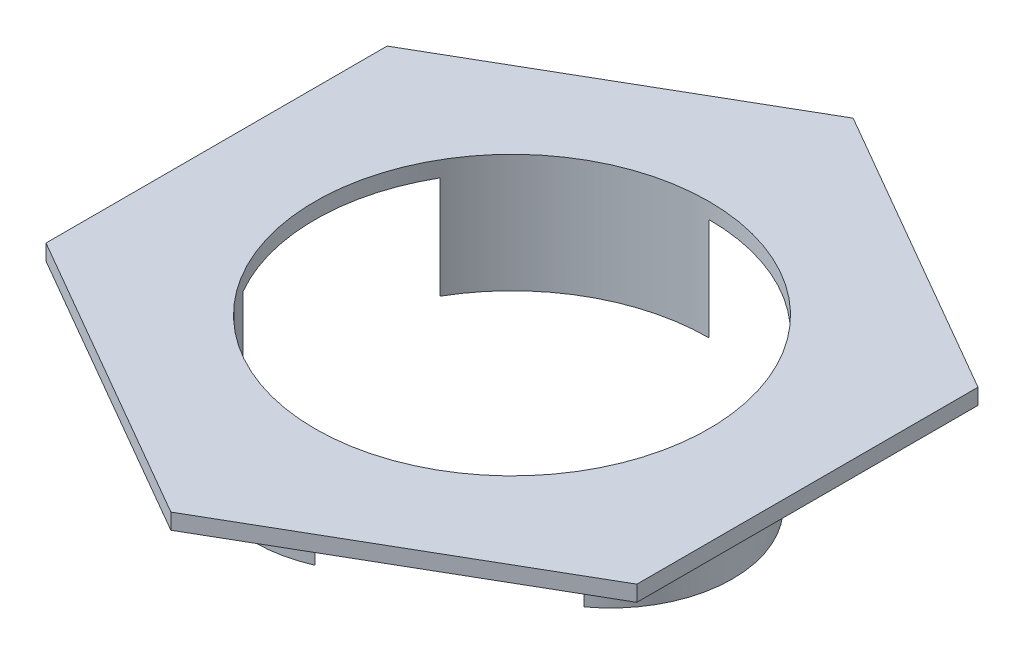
ISO-10303-21;
HEADER;
FILE_DESCRIPTION(('STEP AP214'),'2;1');
FILE_NAME('part.step','',(''),(''),'','','');
FILE_SCHEMA(('AUTOMOTIVE_DESIGN { 1 0 10303 214 1 1 1 1 }'));
ENDSEC;
DATA;
#1=APPLICATION_CONTEXT('core data for automotive mechanical design processes');
#2=APPLICATION_PROTOCOL_DEFINITION('international standard','automotive_design',2000,#1);
#3=PRODUCT_CONTEXT('',#1,'mechanical');
#4=PRODUCT('Part','Part','',(#3));
#5=PRODUCT_RELATED_PRODUCT_CATEGORY('part','',(#4));
#6=PRODUCT_DEFINITION_FORMATION('','',#4);
#7=PRODUCT_DEFINITION_CONTEXT('part definition',#1,'design');
#8=PRODUCT_DEFINITION('design','',#6,#7);
#9=PRODUCT_DEFINITION_SHAPE('','',#8);
#10=(LENGTH_UNIT() NAMED_UNIT(*) SI_UNIT(.MILLI.,.METRE.));
#11=(NAMED_UNIT(*) PLANE_ANGLE_UNIT() SI_UNIT($,.RADIAN.));
#12=(NAMED_UNIT(*) SI_UNIT($,.STERADIAN.) SOLID_ANGLE_UNIT());
#13=UNCERTAINTY_MEASURE_WITH_UNIT(LENGTH_MEASURE(1.E-05),#10,'distance_accuracy_value','');
#14=(GEOMETRIC_REPRESENTATION_CONTEXT(3) GLOBAL_UNCERTAINTY_ASSIGNED_CONTEXT((#13)) GLOBAL_UNIT_ASSIGNED_CONTEXT((#10,
#11,#12)) REPRESENTATION_CONTEXT('',''));
#15=CARTESIAN_POINT('',(0.,0.,0.));
#16=DIRECTION('',(0.,0.,1.));
#17=DIRECTION('',(1.,0.,0.));
#18=AXIS2_PLACEMENT_3D('',#15,#16,#17);
#19=CARTESIAN_POINT('',(0.,25.4,-549.91));
#20=DIRECTION('',(0.,1.,0.));
#21=DIRECTION('',(0.,0.,1.));
#22=AXIS2_PLACEMENT_3D('',#19,#20,#21);
#23=PLANE('',#22);
#24=DIRECTION('',(-0.866025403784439,0.,-0.5));
#25=VECTOR('',#24,1.);
#26=CARTESIAN_POINT('',(476.236029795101,25.4,-274.955));
#27=LINE('',#26,#25);
#28=CARTESIAN_POINT('',(476.236029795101,25.4,-274.955));
#29=VERTEX_POINT('',#28);
#30=CARTESIAN_POINT('',(0.,25.4,-549.91));
#31=VERTEX_POINT('',#30);
#32=EDGE_CURVE('E266',#29,#31,#27,.T.);
#33=ORIENTED_EDGE('',*,*,#32,.T.);
#34=DIRECTION('',(-0.866025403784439,0.,0.5));
#35=VECTOR('',#34,1.);
#36=CARTESIAN_POINT('',(0.,25.4,-549.91));
#37=LINE('',#36,#35);
#38=CARTESIAN_POINT('',(-476.2360297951,25.4,-274.955));
#39=VERTEX_POINT('',#38);
#40=EDGE_CURVE('E284',#31,#39,#37,.T.);
#41=ORIENTED_EDGE('',*,*,#40,.T.);
#42=DIRECTION('',(0.,0.,1.));
#43=VECTOR('',#42,1.);
#44=CARTESIAN_POINT('',(-476.2360297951,25.4,-274.955));
#45=LINE('',#44,#43);
#46=CARTESIAN_POINT('',(-476.2360297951,25.4,274.955));
#47=VERTEX_POINT('',#46);
#48=EDGE_CURVE('E252',#39,#47,#45,.T.);
#49=ORIENTED_EDGE('',*,*,#48,.T.);
#50=DIRECTION('',(0.866025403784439,0.,0.5));
#51=VECTOR('',#50,1.);
#52=CARTESIAN_POINT('',(-476.2360297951,25.4,274.955));
#53=LINE('',#52,#51);
#54=CARTESIAN_POINT('',(0.,25.4,549.91));
#55=VERTEX_POINT('',#54);
#56=EDGE_CURVE('E279',#47,#55,#53,.T.);
#57=ORIENTED_EDGE('',*,*,#56,.T.);
#58=DIRECTION('',(0.866025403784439,0.,-0.5));
#59=VECTOR('',#58,1.);
#60=CARTESIAN_POINT('',(0.,25.4,549.91));
#61=LINE('',#60,#59);
#62=CARTESIAN_POINT('',(476.236029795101,25.4,274.955));
#63=VERTEX_POINT('',#62);
#64=EDGE_CURVE('E281',#55,#63,#61,.T.);
#65=ORIENTED_EDGE('',*,*,#64,.T.);
#66=DIRECTION('',(0.,0.,-1.));
#67=VECTOR('',#66,1.);
#68=CARTESIAN_POINT('',(476.236029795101,25.4,274.955));
#69=LINE('',#68,#67);
#70=EDGE_CURVE('E271',#63,#29,#69,.T.);
#71=ORIENTED_EDGE('',*,*,#70,.T.);
#72=EDGE_LOOP('',(#33,#41,#49,#57,#65,#71));
#73=FACE_BOUND('',#72,.T.);
#74=CARTESIAN_POINT('',(0.,25.4,0.));
#75=DIRECTION('',(0.,1.,0.));
#76=DIRECTION('',(0.,0.,1.));
#77=AXIS2_PLACEMENT_3D('',#74,#75,#76);
#78=CIRCLE('',#77,317.5);
#79=CARTESIAN_POINT('',(0.,25.4,317.5));
#80=VERTEX_POINT('',#79);
#81=EDGE_CURVE('E167',#80,#80,#78,.T.);
#82=ORIENTED_EDGE('',*,*,#81,.F.);
#83=EDGE_LOOP('',(#82));
#84=FACE_BOUND('',#83,.T.);
#85=ADVANCED_FACE('F33',(#73,#84),#23,.T.);
#86=CARTESIAN_POINT('',(0.,0.,-549.91));
#87=DIRECTION('',(0.,1.,0.));
#88=DIRECTION('',(0.,0.,1.));
#89=AXIS2_PLACEMENT_3D('',#86,#87,#88);
#90=PLANE('',#89);
#91=DIRECTION('',(-0.866025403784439,0.,-0.5));
#92=VECTOR('',#91,1.);
#93=CARTESIAN_POINT('',(476.236029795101,0.,-274.955));
#94=LINE('',#93,#92);
#95=CARTESIAN_POINT('',(476.236029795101,0.,-274.955));
#96=VERTEX_POINT('',#95);
#97=CARTESIAN_POINT('',(0.,0.,-549.91));
#98=VERTEX_POINT('',#97);
#99=EDGE_CURVE('E248',#96,#98,#94,.T.);
#100=ORIENTED_EDGE('',*,*,#99,.F.);
#101=DIRECTION('',(0.,0.,-1.));
#102=VECTOR('',#101,1.);
#103=CARTESIAN_POINT('',(476.236029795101,0.,274.955));
#104=LINE('',#103,#102);
#105=CARTESIAN_POINT('',(476.236029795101,0.,274.955));
#106=VERTEX_POINT('',#105);
#107=EDGE_CURVE('E264',#106,#96,#104,.T.);
#108=ORIENTED_EDGE('',*,*,#107,.F.);
#109=DIRECTION('',(0.866025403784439,0.,-0.5));
#110=VECTOR('',#109,1.);
#111=CARTESIAN_POINT('',(0.,0.,549.91));
#112=LINE('',#111,#110);
#113=CARTESIAN_POINT('',(0.,0.,549.91));
#114=VERTEX_POINT('',#113);
#115=EDGE_CURVE('E259',#114,#106,#112,.T.);
#116=ORIENTED_EDGE('',*,*,#115,.F.);
#117=DIRECTION('',(0.866025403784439,0.,0.5));
#118=VECTOR('',#117,1.);
#119=CARTESIAN_POINT('',(-476.2360297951,0.,274.955));
#120=LINE('',#119,#118);
#121=CARTESIAN_POINT('',(-476.2360297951,0.,274.955));
#122=VERTEX_POINT('',#121);
#123=EDGE_CURVE('E257',#122,#114,#120,.T.);
#124=ORIENTED_EDGE('',*,*,#123,.F.);
#125=DIRECTION('',(0.,0.,1.));
#126=VECTOR('',#125,1.);
#127=CARTESIAN_POINT('',(-476.2360297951,0.,-274.955));
#128=LINE('',#127,#126);
#129=CARTESIAN_POINT('',(-476.2360297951,0.,-274.955));
#130=VERTEX_POINT('',#129);
#131=EDGE_CURVE('E247',#130,#122,#128,.T.);
#132=ORIENTED_EDGE('',*,*,#131,.F.);
#133=DIRECTION('',(-0.866025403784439,0.,0.5));
#134=VECTOR('',#133,1.);
#135=CARTESIAN_POINT('',(0.,0.,-549.91));
#136=LINE('',#135,#134);
#137=EDGE_CURVE('E240',#98,#130,#136,.T.);
#138=ORIENTED_EDGE('',*,*,#137,.F.);
#139=EDGE_LOOP('',(#100,#108,#116,#124,#132,#138));
#140=FACE_BOUND('',#139,.T.);
#141=CARTESIAN_POINT('',(0.,0.,0.));
#142=DIRECTION('',(0.,1.,0.));
#143=DIRECTION('',(0.,0.,1.));
#144=AXIS2_PLACEMENT_3D('',#141,#142,#143);
#145=CIRCLE('',#144,317.5);
#146=CARTESIAN_POINT('',(274.963065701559,0.,-158.75));
#147=VERTEX_POINT('',#146);
#148=CARTESIAN_POINT('',(-4.85722573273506E-13,0.,-317.5));
#149=VERTEX_POINT('',#148);
#150=EDGE_CURVE('E51',#147,#149,#145,.T.);
#151=ORIENTED_EDGE('',*,*,#150,.T.);
#152=CARTESIAN_POINT('',(-79.5079519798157,0.,-137.711812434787));
#153=DIRECTION('',(0.,-1.,0.));
#154=DIRECTION('',(0.,0.,-1.));
#155=AXIS2_PLACEMENT_3D('',#152,#153,#154);
#156=CIRCLE('',#155,196.584096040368);
#157=CARTESIAN_POINT('',(-274.963065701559,0.,-158.75));
#158=VERTEX_POINT('',#157);
#159=EDGE_CURVE('E132',#149,#158,#156,.F.);
#160=ORIENTED_EDGE('',*,*,#159,.T.);
#161=CARTESIAN_POINT('',(-274.963065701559,0.,158.75));
#162=VERTEX_POINT('',#161);
#163=EDGE_CURVE('E37',#158,#162,#145,.T.);
#164=ORIENTED_EDGE('',*,*,#163,.T.);
#165=CARTESIAN_POINT('',(-79.5079519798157,0.,137.711812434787));
#166=DIRECTION('',(0.,-1.,0.));
#167=DIRECTION('',(0.,0.,-1.));
#168=AXIS2_PLACEMENT_3D('',#165,#166,#167);
#169=CIRCLE('',#168,196.584096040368);
#170=CARTESIAN_POINT('',(-3.60822483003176E-13,0.,317.5));
#171=VERTEX_POINT('',#170);
#172=EDGE_CURVE('E158',#162,#171,#169,.F.);
#173=ORIENTED_EDGE('',*,*,#172,.T.);
#174=CARTESIAN_POINT('',(274.963065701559,0.,158.75));
#175=VERTEX_POINT('',#174);
#176=EDGE_CURVE('E57',#171,#175,#145,.T.);
#177=ORIENTED_EDGE('',*,*,#176,.T.);
#178=CARTESIAN_POINT('',(159.015903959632,0.,0.));
#179=DIRECTION('',(0.,-1.,0.));
#180=DIRECTION('',(0.,0.,-1.));
#181=AXIS2_PLACEMENT_3D('',#178,#179,#180);
#182=CIRCLE('',#181,196.584096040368);
#183=EDGE_CURVE('E134',#175,#147,#182,.F.);
#184=ORIENTED_EDGE('',*,*,#183,.T.);
#185=EDGE_LOOP('',(#151,#160,#164,#173,#177,#184));
#186=FACE_BOUND('',#185,.T.);
#187=ADVANCED_FACE('F180',(#140,#186),#90,.F.);
#188=CARTESIAN_POINT('',(476.236029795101,25.4,-274.955));
#189=DIRECTION('',(-0.5,0.,0.866025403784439));
#190=DIRECTION('',(0.866025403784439,0.,0.5));
#191=AXIS2_PLACEMENT_3D('',#188,#189,#190);
#192=PLANE('',#191);
#193=ORIENTED_EDGE('',*,*,#99,.T.);
#194=DIRECTION('',(0.,-1.,0.));
#195=VECTOR('',#194,1.);
#196=CARTESIAN_POINT('',(0.,25.4,-549.91));
#197=LINE('',#196,#195);
#198=EDGE_CURVE('E11',#31,#98,#197,.T.);
#199=ORIENTED_EDGE('',*,*,#198,.F.);
#200=ORIENTED_EDGE('',*,*,#32,.F.);
#201=DIRECTION('',(0.,-1.,0.));
#202=VECTOR('',#201,1.);
#203=CARTESIAN_POINT('',(476.236029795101,25.4,-274.955));
#204=LINE('',#203,#202);
#205=EDGE_CURVE('E267',#29,#96,#204,.T.);
#206=ORIENTED_EDGE('',*,*,#205,.T.);
#207=EDGE_LOOP('',(#193,#199,#200,#206));
#208=FACE_BOUND('',#207,.T.);
#209=ADVANCED_FACE('F35',(#208),#192,.F.);
#210=CARTESIAN_POINT('',(0.,25.4,-549.91));
#211=DIRECTION('',(0.5,0.,0.866025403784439));
#212=DIRECTION('',(0.866025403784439,0.,-0.5));
#213=AXIS2_PLACEMENT_3D('',#210,#211,#212);
#214=PLANE('',#213);
#215=ORIENTED_EDGE('',*,*,#137,.T.);
#216=DIRECTION('',(0.,-1.,0.));
#217=VECTOR('',#216,1.);
#218=CARTESIAN_POINT('',(-476.2360297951,25.4,-274.955));
#219=LINE('',#218,#217);
#220=EDGE_CURVE('E43',#39,#130,#219,.T.);
#221=ORIENTED_EDGE('',*,*,#220,.F.);
#222=ORIENTED_EDGE('',*,*,#40,.F.);
#223=ORIENTED_EDGE('',*,*,#198,.T.);
#224=EDGE_LOOP('',(#215,#221,#222,#223));
#225=FACE_BOUND('',#224,.T.);
#226=ADVANCED_FACE('F231',(#225),#214,.F.);
#227=CARTESIAN_POINT('',(-476.2360297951,25.4,-274.955));
#228=DIRECTION('',(1.,0.,0.));
#229=DIRECTION('',(0.,0.,-1.));
#230=AXIS2_PLACEMENT_3D('',#227,#228,#229);
#231=PLANE('',#230);
#232=ORIENTED_EDGE('',*,*,#131,.T.);
#233=DIRECTION('',(0.,-1.,0.));
#234=VECTOR('',#233,1.);
#235=CARTESIAN_POINT('',(-476.2360297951,25.4,274.955));
#236=LINE('',#235,#234);
#237=EDGE_CURVE('E253',#47,#122,#236,.T.);
#238=ORIENTED_EDGE('',*,*,#237,.F.);
#239=ORIENTED_EDGE('',*,*,#48,.F.);
#240=ORIENTED_EDGE('',*,*,#220,.T.);
#241=EDGE_LOOP('',(#232,#238,#239,#240));
#242=FACE_BOUND('',#241,.T.);
#243=ADVANCED_FACE('F228',(#242),#231,.F.);
#244=CARTESIAN_POINT('',(-476.2360297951,25.4,274.955));
#245=DIRECTION('',(0.5,0.,-0.866025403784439));
#246=DIRECTION('',(-0.866025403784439,0.,-0.5));
#247=AXIS2_PLACEMENT_3D('',#244,#245,#246);
#248=PLANE('',#247);
#249=ORIENTED_EDGE('',*,*,#123,.T.);
#250=DIRECTION('',(0.,-1.,0.));
#251=VECTOR('',#250,1.);
#252=CARTESIAN_POINT('',(0.,25.4,549.91));
#253=LINE('',#252,#251);
#254=EDGE_CURVE('E274',#55,#114,#253,.T.);
#255=ORIENTED_EDGE('',*,*,#254,.F.);
#256=ORIENTED_EDGE('',*,*,#56,.F.);
#257=ORIENTED_EDGE('',*,*,#237,.T.);
#258=EDGE_LOOP('',(#249,#255,#256,#257));
#259=FACE_BOUND('',#258,.T.);
#260=ADVANCED_FACE('F224',(#259),#248,.F.);
#261=CARTESIAN_POINT('',(0.,25.4,549.91));
#262=DIRECTION('',(-0.5,0.,-0.866025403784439));
#263=DIRECTION('',(-0.866025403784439,0.,0.5));
#264=AXIS2_PLACEMENT_3D('',#261,#262,#263);
#265=PLANE('',#264);
#266=ORIENTED_EDGE('',*,*,#115,.T.);
#267=DIRECTION('',(0.,-1.,0.));
#268=VECTOR('',#267,1.);
#269=CARTESIAN_POINT('',(476.236029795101,25.4,274.955));
#270=LINE('',#269,#268);
#271=EDGE_CURVE('E270',#63,#106,#270,.T.);
#272=ORIENTED_EDGE('',*,*,#271,.F.);
#273=ORIENTED_EDGE('',*,*,#64,.F.);
#274=ORIENTED_EDGE('',*,*,#254,.T.);
#275=EDGE_LOOP('',(#266,#272,#273,#274));
#276=FACE_BOUND('',#275,.T.);
#277=ADVANCED_FACE('F220',(#276),#265,.F.);
#278=CARTESIAN_POINT('',(476.236029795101,25.4,274.955));
#279=DIRECTION('',(-1.,0.,0.));
#280=DIRECTION('',(0.,0.,1.));
#281=AXIS2_PLACEMENT_3D('',#278,#279,#280);
#282=PLANE('',#281);
#283=ORIENTED_EDGE('',*,*,#107,.T.);
#284=ORIENTED_EDGE('',*,*,#205,.F.);
#285=ORIENTED_EDGE('',*,*,#70,.F.);
#286=ORIENTED_EDGE('',*,*,#271,.T.);
#287=EDGE_LOOP('',(#283,#284,#285,#286));
#288=FACE_BOUND('',#287,.T.);
#289=ADVANCED_FACE('F217',(#288),#282,.F.);
#290=CARTESIAN_POINT('',(0.,25.4,0.));
#291=DIRECTION('',(0.,-1.,0.));
#292=DIRECTION('',(0.,0.,-1.));
#293=AXIS2_PLACEMENT_3D('',#290,#291,#292);
#294=CYLINDRICAL_SURFACE('',#293,317.5);
#295=ORIENTED_EDGE('',*,*,#81,.T.);
#296=EDGE_LOOP('',(#295));
#297=FACE_BOUND('',#296,.T.);
#298=ORIENTED_EDGE('',*,*,#176,.F.);
#299=DIRECTION('',(0.,1.,0.));
#300=VECTOR('',#299,1.);
#301=CARTESIAN_POINT('',(0.,-165.1,317.5));
#302=LINE('',#301,#300);
#303=CARTESIAN_POINT('',(0.,-165.1,317.5));
#304=VERTEX_POINT('',#303);
#305=EDGE_CURVE('E164',#304,#171,#302,.T.);
#306=ORIENTED_EDGE('',*,*,#305,.F.);
#307=CARTESIAN_POINT('',(0.,-165.1,0.));
#308=DIRECTION('',(0.,-1.,0.));
#309=DIRECTION('',(0.,0.,-1.));
#310=AXIS2_PLACEMENT_3D('',#307,#308,#309);
#311=CIRCLE('',#310,317.5);
#312=CARTESIAN_POINT('',(-274.963065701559,-165.1,158.75));
#313=VERTEX_POINT('',#312);
#314=EDGE_CURVE('E162',#313,#304,#311,.F.);
#315=ORIENTED_EDGE('',*,*,#314,.F.);
#316=DIRECTION('',(0.,1.,0.));
#317=VECTOR('',#316,1.);
#318=CARTESIAN_POINT('',(-274.963065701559,-165.1,158.75));
#319=LINE('',#318,#317);
#320=EDGE_CURVE('E174',#313,#162,#319,.T.);
#321=ORIENTED_EDGE('',*,*,#320,.T.);
#322=ORIENTED_EDGE('',*,*,#163,.F.);
#323=DIRECTION('',(0.,1.,0.));
#324=VECTOR('',#323,1.);
#325=CARTESIAN_POINT('',(-274.963065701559,-165.1,-158.75));
#326=LINE('',#325,#324);
#327=CARTESIAN_POINT('',(-274.963065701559,-165.1,-158.75));
#328=VERTEX_POINT('',#327);
#329=EDGE_CURVE('E135',#328,#158,#326,.T.);
#330=ORIENTED_EDGE('',*,*,#329,.F.);
#331=CARTESIAN_POINT('',(0.,-165.1,0.));
#332=DIRECTION('',(0.,-1.,0.));
#333=DIRECTION('',(0.,0.,-1.));
#334=AXIS2_PLACEMENT_3D('',#331,#332,#333);
#335=CIRCLE('',#334,317.5);
#336=CARTESIAN_POINT('',(0.,-165.1,-317.5));
#337=VERTEX_POINT('',#336);
#338=EDGE_CURVE('E138',#337,#328,#335,.F.);
#339=ORIENTED_EDGE('',*,*,#338,.F.);
#340=DIRECTION('',(0.,1.,0.));
#341=VECTOR('',#340,1.);
#342=CARTESIAN_POINT('',(0.,-165.1,-317.5));
#343=LINE('',#342,#341);
#344=EDGE_CURVE('E126',#337,#149,#343,.T.);
#345=ORIENTED_EDGE('',*,*,#344,.T.);
#346=ORIENTED_EDGE('',*,*,#150,.F.);
#347=DIRECTION('',(0.,1.,0.));
#348=VECTOR('',#347,1.);
#349=CARTESIAN_POINT('',(274.963065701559,-165.1,-158.75));
#350=LINE('',#349,#348);
#351=CARTESIAN_POINT('',(274.963065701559,-165.1,-158.75));
#352=VERTEX_POINT('',#351);
#353=EDGE_CURVE('E152',#352,#147,#350,.T.);
#354=ORIENTED_EDGE('',*,*,#353,.F.);
#355=CARTESIAN_POINT('',(0.,-165.1,0.));
#356=DIRECTION('',(0.,-1.,0.));
#357=DIRECTION('',(0.,0.,-1.));
#358=AXIS2_PLACEMENT_3D('',#355,#356,#357);
#359=CIRCLE('',#358,317.5);
#360=CARTESIAN_POINT('',(274.963065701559,-165.1,158.75));
#361=VERTEX_POINT('',#360);
#362=EDGE_CURVE('E150',#361,#352,#359,.F.);
#363=ORIENTED_EDGE('',*,*,#362,.F.);
#364=DIRECTION('',(0.,1.,0.));
#365=VECTOR('',#364,1.);
#366=CARTESIAN_POINT('',(274.963065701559,-165.1,158.75));
#367=LINE('',#366,#365);
#368=EDGE_CURVE('E156',#361,#175,#367,.T.);
#369=ORIENTED_EDGE('',*,*,#368,.T.);
#370=EDGE_LOOP('',(#298,#306,#315,#321,#322,#330,#339,#345,#346,#354,#363,#369));
#371=FACE_BOUND('',#370,.T.);
#372=ADVANCED_FACE('F139',(#297,#371),#294,.F.);
#373=CARTESIAN_POINT('',(-79.5079519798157,-165.1,137.711812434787));
#374=DIRECTION('',(0.,1.,0.));
#375=DIRECTION('',(0.,0.,1.));
#376=AXIS2_PLACEMENT_3D('',#373,#374,#375);
#377=CYLINDRICAL_SURFACE('',#376,196.584096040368);
#378=ORIENTED_EDGE('',*,*,#172,.F.);
#379=ORIENTED_EDGE('',*,*,#320,.F.);
#380=CARTESIAN_POINT('',(-79.5079519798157,-165.1,137.711812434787));
#381=DIRECTION('',(0.,-1.,0.));
#382=DIRECTION('',(0.,0.,-1.));
#383=AXIS2_PLACEMENT_3D('',#380,#381,#382);
#384=CIRCLE('',#383,196.584096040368);
#385=EDGE_CURVE('E159',#313,#304,#384,.F.);
#386=ORIENTED_EDGE('',*,*,#385,.T.);
#387=ORIENTED_EDGE('',*,*,#305,.T.);
#388=EDGE_LOOP('',(#378,#379,#386,#387));
#389=FACE_BOUND('',#388,.T.);
#390=ADVANCED_FACE('F186',(#389),#377,.T.);
#391=CARTESIAN_POINT('',(2.9422624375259E-13,-165.1,-1131.80756881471));
#392=DIRECTION('',(0.,-1.,0.));
#393=DIRECTION('',(0.,0.,-1.));
#394=AXIS2_PLACEMENT_3D('',#391,#392,#393);
#395=PLANE('',#394);
#396=ORIENTED_EDGE('',*,*,#385,.F.);
#397=ORIENTED_EDGE('',*,*,#314,.T.);
#398=EDGE_LOOP('',(#396,#397));
#399=FACE_BOUND('',#398,.T.);
#400=ADVANCED_FACE('F202',(#399),#395,.T.);
#401=CARTESIAN_POINT('',(159.015903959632,-165.1,0.));
#402=DIRECTION('',(0.,1.,0.));
#403=DIRECTION('',(0.,0.,1.));
#404=AXIS2_PLACEMENT_3D('',#401,#402,#403);
#405=CYLINDRICAL_SURFACE('',#404,196.584096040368);
#406=ORIENTED_EDGE('',*,*,#183,.F.);
#407=ORIENTED_EDGE('',*,*,#368,.F.);
#408=CARTESIAN_POINT('',(159.015903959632,-165.1,0.));
#409=DIRECTION('',(0.,-1.,0.));
#410=DIRECTION('',(0.,0.,-1.));
#411=AXIS2_PLACEMENT_3D('',#408,#409,#410);
#412=CIRCLE('',#411,196.584096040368);
#413=EDGE_CURVE('E147',#361,#352,#412,.F.);
#414=ORIENTED_EDGE('',*,*,#413,.T.);
#415=ORIENTED_EDGE('',*,*,#353,.T.);
#416=EDGE_LOOP('',(#406,#407,#414,#415));
#417=FACE_BOUND('',#416,.T.);
#418=ADVANCED_FACE('F192',(#417),#405,.T.);
#419=CARTESIAN_POINT('',(2.9422624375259E-13,-165.1,-1131.80756881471));
#420=DIRECTION('',(0.,-1.,0.));
#421=DIRECTION('',(0.,0.,-1.));
#422=AXIS2_PLACEMENT_3D('',#419,#420,#421);
#423=PLANE('',#422);
#424=ORIENTED_EDGE('',*,*,#413,.F.);
#425=ORIENTED_EDGE('',*,*,#362,.T.);
#426=EDGE_LOOP('',(#424,#425));
#427=FACE_BOUND('',#426,.T.);
#428=ADVANCED_FACE('F194',(#427),#423,.T.);
#429=CARTESIAN_POINT('',(-79.5079519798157,-165.1,-137.711812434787));
#430=DIRECTION('',(0.,1.,0.));
#431=DIRECTION('',(0.,0.,1.));
#432=AXIS2_PLACEMENT_3D('',#429,#430,#431);
#433=CYLINDRICAL_SURFACE('',#432,196.584096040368);
#434=ORIENTED_EDGE('',*,*,#159,.F.);
#435=ORIENTED_EDGE('',*,*,#344,.F.);
#436=CARTESIAN_POINT('',(-79.5079519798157,-165.1,-137.711812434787));
#437=DIRECTION('',(0.,-1.,0.));
#438=DIRECTION('',(0.,0.,-1.));
#439=AXIS2_PLACEMENT_3D('',#436,#437,#438);
#440=CIRCLE('',#439,196.584096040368);
#441=EDGE_CURVE('E131',#337,#328,#440,.F.);
#442=ORIENTED_EDGE('',*,*,#441,.T.);
#443=ORIENTED_EDGE('',*,*,#329,.T.);
#444=EDGE_LOOP('',(#434,#435,#442,#443));
#445=FACE_BOUND('',#444,.T.);
#446=ADVANCED_FACE('F128',(#445),#433,.T.);
#447=CARTESIAN_POINT('',(2.9422624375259E-13,-165.1,-1131.80756881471));
#448=DIRECTION('',(0.,-1.,0.));
#449=DIRECTION('',(0.,0.,-1.));
#450=AXIS2_PLACEMENT_3D('',#447,#448,#449);
#451=PLANE('',#450);
#452=ORIENTED_EDGE('',*,*,#441,.F.);
#453=ORIENTED_EDGE('',*,*,#338,.T.);
#454=EDGE_LOOP('',(#452,#453));
#455=FACE_BOUND('',#454,.T.);
#456=ADVANCED_FACE('F142',(#455),#451,.T.);
#457=CLOSED_SHELL('',(#85,#187,#209,#226,#243,#260,#277,#289,#372,#390,#400,#418,#428,#446,#456));
#458=MANIFOLD_SOLID_BREP('B2',#457);
#459=ADVANCED_BREP_SHAPE_REPRESENTATION('',(#18,#458),#14);
#460=SHAPE_DEFINITION_REPRESENTATION(#9,#459);
ENDSEC;
END-ISO-10303-21;
